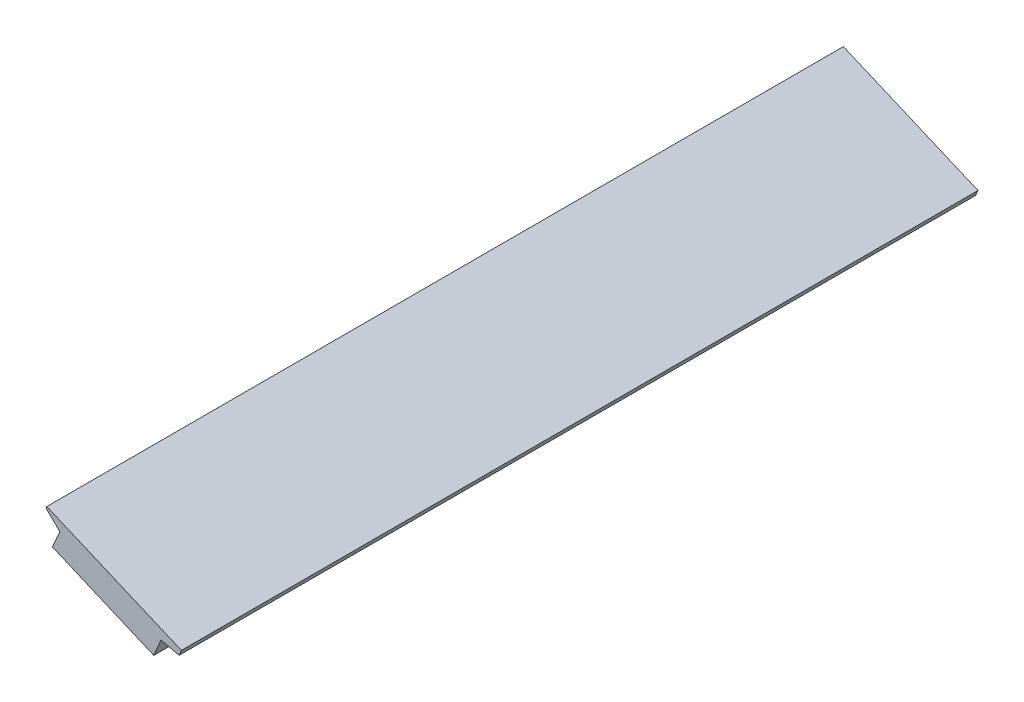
ISO-10303-21;
HEADER;
FILE_DESCRIPTION(('STEP AP214'),'2;1');
FILE_NAME('part.step','',(''),(''),'','','');
FILE_SCHEMA(('AUTOMOTIVE_DESIGN { 1 0 10303 214 1 1 1 1 }'));
ENDSEC;
DATA;
#1=APPLICATION_CONTEXT('core data for automotive mechanical design processes');
#2=APPLICATION_PROTOCOL_DEFINITION('international standard','automotive_design',2000,#1);
#3=PRODUCT_CONTEXT('',#1,'mechanical');
#4=PRODUCT('Part','Part','',(#3));
#5=PRODUCT_RELATED_PRODUCT_CATEGORY('part','',(#4));
#6=PRODUCT_DEFINITION_FORMATION('','',#4);
#7=PRODUCT_DEFINITION_CONTEXT('part definition',#1,'design');
#8=PRODUCT_DEFINITION('design','',#6,#7);
#9=PRODUCT_DEFINITION_SHAPE('','',#8);
#10=(LENGTH_UNIT() NAMED_UNIT(*) SI_UNIT(.MILLI.,.METRE.));
#11=(NAMED_UNIT(*) PLANE_ANGLE_UNIT() SI_UNIT($,.RADIAN.));
#12=(NAMED_UNIT(*) SI_UNIT($,.STERADIAN.) SOLID_ANGLE_UNIT());
#13=UNCERTAINTY_MEASURE_WITH_UNIT(LENGTH_MEASURE(1.E-05),#10,'distance_accuracy_value','');
#14=(GEOMETRIC_REPRESENTATION_CONTEXT(3) GLOBAL_UNCERTAINTY_ASSIGNED_CONTEXT((#13)) GLOBAL_UNIT_ASSIGNED_CONTEXT((#10,
#11,#12)) REPRESENTATION_CONTEXT('',''));
#15=CARTESIAN_POINT('',(0.,0.,0.));
#16=DIRECTION('',(0.,0.,1.));
#17=DIRECTION('',(1.,0.,0.));
#18=AXIS2_PLACEMENT_3D('',#15,#16,#17);
#19=CARTESIAN_POINT('',(-20.,-17.3718686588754,43.5));
#20=DIRECTION('',(-0.920081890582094,0.391726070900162,0.));
#21=DIRECTION('',(-0.391726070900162,-0.920081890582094,0.));
#22=AXIS2_PLACEMENT_3D('',#19,#20,#21);
#23=PLANE('',#22);
#24=DIRECTION('',(0.391726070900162,0.920081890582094,0.));
#25=VECTOR('',#24,1.);
#26=CARTESIAN_POINT('',(-20.,-17.3718686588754,-43.5));
#27=LINE('',#26,#25);
#28=CARTESIAN_POINT('',(-20.7866948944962,-19.2196489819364,-43.5));
#29=VERTEX_POINT('',#28);
#30=CARTESIAN_POINT('',(-20.,-17.3718686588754,-43.5));
#31=VERTEX_POINT('',#30);
#32=EDGE_CURVE('E94',#29,#31,#27,.T.);
#33=ORIENTED_EDGE('',*,*,#32,.T.);
#34=DIRECTION('',(0.,0.,-1.));
#35=VECTOR('',#34,1.);
#36=CARTESIAN_POINT('',(-20.,-17.3718686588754,43.5));
#37=LINE('',#36,#35);
#38=CARTESIAN_POINT('',(-20.,-17.3718686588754,43.5));
#39=VERTEX_POINT('',#38);
#40=EDGE_CURVE('E11',#39,#31,#37,.T.);
#41=ORIENTED_EDGE('',*,*,#40,.F.);
#42=DIRECTION('',(0.391726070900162,0.920081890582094,0.));
#43=VECTOR('',#42,1.);
#44=CARTESIAN_POINT('',(-20.,-17.3718686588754,43.5));
#45=LINE('',#44,#43);
#46=CARTESIAN_POINT('',(-20.7866948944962,-19.2196489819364,43.5));
#47=VERTEX_POINT('',#46);
#48=EDGE_CURVE('E121',#47,#39,#45,.T.);
#49=ORIENTED_EDGE('',*,*,#48,.F.);
#50=DIRECTION('',(0.,0.,-1.));
#51=VECTOR('',#50,1.);
#52=CARTESIAN_POINT('',(-20.7866948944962,-19.2196489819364,43.5));
#53=LINE('',#52,#51);
#54=EDGE_CURVE('E107',#47,#29,#53,.T.);
#55=ORIENTED_EDGE('',*,*,#54,.T.);
#56=EDGE_LOOP('',(#33,#41,#49,#55));
#57=FACE_BOUND('',#56,.T.);
#58=ADVANCED_FACE('F26',(#57),#23,.F.);
#59=CARTESIAN_POINT('',(-18.0216924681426,-17.830850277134,43.5));
#60=DIRECTION('',(0.226004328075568,0.974126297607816,0.));
#61=DIRECTION('',(-0.974126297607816,0.226004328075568,0.));
#62=AXIS2_PLACEMENT_3D('',#59,#60,#61);
#63=PLANE('',#62);
#64=DIRECTION('',(0.974126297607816,-0.226004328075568,0.));
#65=VECTOR('',#64,1.);
#66=CARTESIAN_POINT('',(-18.0216924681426,-17.830850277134,-43.5));
#67=LINE('',#66,#65);
#68=CARTESIAN_POINT('',(-18.0216924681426,-17.830850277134,-43.5));
#69=VERTEX_POINT('',#68);
#70=EDGE_CURVE('E90',#31,#69,#67,.T.);
#71=ORIENTED_EDGE('',*,*,#70,.T.);
#72=DIRECTION('',(0.,0.,-1.));
#73=VECTOR('',#72,1.);
#74=CARTESIAN_POINT('',(-18.0216924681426,-17.830850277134,43.5));
#75=LINE('',#74,#73);
#76=CARTESIAN_POINT('',(-18.0216924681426,-17.830850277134,43.5));
#77=VERTEX_POINT('',#76);
#78=EDGE_CURVE('E33',#77,#69,#75,.T.);
#79=ORIENTED_EDGE('',*,*,#78,.F.);
#80=DIRECTION('',(0.974126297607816,-0.226004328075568,0.));
#81=VECTOR('',#80,1.);
#82=CARTESIAN_POINT('',(-18.0216924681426,-17.830850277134,43.5));
#83=LINE('',#82,#81);
#84=EDGE_CURVE('E103',#39,#77,#83,.T.);
#85=ORIENTED_EDGE('',*,*,#84,.F.);
#86=ORIENTED_EDGE('',*,*,#40,.T.);
#87=EDGE_LOOP('',(#71,#79,#85,#86));
#88=FACE_BOUND('',#87,.T.);
#89=ADVANCED_FACE('F102',(#88),#63,.F.);
#90=CARTESIAN_POINT('',(-17.7713280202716,-17.2425890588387,43.5));
#91=DIRECTION('',(-0.920131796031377,0.391608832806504,0.));
#92=DIRECTION('',(-0.391608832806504,-0.920131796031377,0.));
#93=AXIS2_PLACEMENT_3D('',#90,#91,#92);
#94=PLANE('',#93);
#95=DIRECTION('',(0.391608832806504,0.920131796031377,0.));
#96=VECTOR('',#95,1.);
#97=CARTESIAN_POINT('',(-17.7713280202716,-17.2425890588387,-43.5));
#98=LINE('',#97,#96);
#99=CARTESIAN_POINT('',(-17.7713280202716,-17.2425890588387,-43.5));
#100=VERTEX_POINT('',#99);
#101=EDGE_CURVE('E96',#69,#100,#98,.T.);
#102=ORIENTED_EDGE('',*,*,#101,.T.);
#103=DIRECTION('',(0.,0.,-1.));
#104=VECTOR('',#103,1.);
#105=CARTESIAN_POINT('',(-17.7713280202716,-17.2425890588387,43.5));
#106=LINE('',#105,#104);
#107=CARTESIAN_POINT('',(-17.7713280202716,-17.2425890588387,43.5));
#108=VERTEX_POINT('',#107);
#109=EDGE_CURVE('E147',#108,#100,#106,.T.);
#110=ORIENTED_EDGE('',*,*,#109,.F.);
#111=DIRECTION('',(0.391608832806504,0.920131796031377,0.));
#112=VECTOR('',#111,1.);
#113=CARTESIAN_POINT('',(-17.7713280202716,-17.2425890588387,43.5));
#114=LINE('',#113,#112);
#115=EDGE_CURVE('E124',#77,#108,#114,.T.);
#116=ORIENTED_EDGE('',*,*,#115,.F.);
#117=ORIENTED_EDGE('',*,*,#78,.T.);
#118=EDGE_LOOP('',(#102,#110,#116,#117));
#119=FACE_BOUND('',#118,.T.);
#120=ADVANCED_FACE('F151',(#119),#94,.F.);
#121=CARTESIAN_POINT('',(-32.4736629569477,-10.9852634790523,43.5));
#122=DIRECTION('',(-0.391608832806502,-0.920131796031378,0.));
#123=DIRECTION('',(0.920131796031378,-0.391608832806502,0.));
#124=AXIS2_PLACEMENT_3D('',#121,#122,#123);
#125=PLANE('',#124);
#126=DIRECTION('',(-0.920131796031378,0.391608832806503,0.));
#127=VECTOR('',#126,1.);
#128=CARTESIAN_POINT('',(-32.4736629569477,-10.9852634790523,-43.5));
#129=LINE('',#128,#127);
#130=CARTESIAN_POINT('',(-32.4736629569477,-10.9852634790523,-43.5));
#131=VERTEX_POINT('',#130);
#132=EDGE_CURVE('E111',#100,#131,#129,.T.);
#133=ORIENTED_EDGE('',*,*,#132,.T.);
#134=DIRECTION('',(0.,0.,-1.));
#135=VECTOR('',#134,1.);
#136=CARTESIAN_POINT('',(-32.4736629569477,-10.9852634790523,43.5));
#137=LINE('',#136,#135);
#138=CARTESIAN_POINT('',(-32.4736629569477,-10.9852634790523,43.5));
#139=VERTEX_POINT('',#138);
#140=EDGE_CURVE('E144',#139,#131,#137,.T.);
#141=ORIENTED_EDGE('',*,*,#140,.F.);
#142=DIRECTION('',(-0.920131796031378,0.391608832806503,0.));
#143=VECTOR('',#142,1.);
#144=CARTESIAN_POINT('',(-32.4736629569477,-10.9852634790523,43.5));
#145=LINE('',#144,#143);
#146=EDGE_CURVE('E126',#108,#139,#145,.T.);
#147=ORIENTED_EDGE('',*,*,#146,.F.);
#148=ORIENTED_EDGE('',*,*,#109,.T.);
#149=EDGE_LOOP('',(#133,#141,#147,#148));
#150=FACE_BOUND('',#149,.T.);
#151=ADVANCED_FACE('F159',(#150),#125,.F.);
#152=CARTESIAN_POINT('',(-32.5603672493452,-11.1769443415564,43.5));
#153=DIRECTION('',(0.91112305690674,-0.412134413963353,0.));
#154=DIRECTION('',(0.412134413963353,0.91112305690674,0.));
#155=AXIS2_PLACEMENT_3D('',#152,#153,#154);
#156=PLANE('',#155);
#157=DIRECTION('',(-0.412134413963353,-0.91112305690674,0.));
#158=VECTOR('',#157,1.);
#159=CARTESIAN_POINT('',(-32.5603672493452,-11.1769443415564,-43.5));
#160=LINE('',#159,#158);
#161=CARTESIAN_POINT('',(-32.5603672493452,-11.1769443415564,-43.5));
#162=VERTEX_POINT('',#161);
#163=EDGE_CURVE('E113',#131,#162,#160,.T.);
#164=ORIENTED_EDGE('',*,*,#163,.T.);
#165=DIRECTION('',(0.,0.,-1.));
#166=VECTOR('',#165,1.);
#167=CARTESIAN_POINT('',(-32.5603672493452,-11.1769443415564,43.5));
#168=LINE('',#167,#166);
#169=CARTESIAN_POINT('',(-32.5603672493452,-11.1769443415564,43.5));
#170=VERTEX_POINT('',#169);
#171=EDGE_CURVE('E141',#170,#162,#168,.T.);
#172=ORIENTED_EDGE('',*,*,#171,.F.);
#173=DIRECTION('',(-0.412134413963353,-0.91112305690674,0.));
#174=VECTOR('',#173,1.);
#175=CARTESIAN_POINT('',(-32.5603672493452,-11.1769443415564,43.5));
#176=LINE('',#175,#174);
#177=EDGE_CURVE('E128',#139,#170,#176,.T.);
#178=ORIENTED_EDGE('',*,*,#177,.F.);
#179=ORIENTED_EDGE('',*,*,#140,.T.);
#180=EDGE_LOOP('',(#164,#172,#178,#179));
#181=FACE_BOUND('',#180,.T.);
#182=ADVANCED_FACE('F162',(#181),#156,.F.);
#183=CARTESIAN_POINT('',(-31.0381304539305,-12.6644565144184,43.5));
#184=DIRECTION('',(0.698902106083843,0.715217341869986,0.));
#185=DIRECTION('',(-0.715217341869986,0.698902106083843,0.));
#186=AXIS2_PLACEMENT_3D('',#183,#184,#185);
#187=PLANE('',#186);
#188=DIRECTION('',(0.715217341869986,-0.698902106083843,0.));
#189=VECTOR('',#188,1.);
#190=CARTESIAN_POINT('',(-31.0381304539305,-12.6644565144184,-43.5));
#191=LINE('',#190,#189);
#192=CARTESIAN_POINT('',(-31.0381304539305,-12.6644565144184,-43.5));
#193=VERTEX_POINT('',#192);
#194=EDGE_CURVE('E115',#162,#193,#191,.T.);
#195=ORIENTED_EDGE('',*,*,#194,.T.);
#196=DIRECTION('',(0.,0.,-1.));
#197=VECTOR('',#196,1.);
#198=CARTESIAN_POINT('',(-31.0381304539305,-12.6644565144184,43.5));
#199=LINE('',#198,#197);
#200=CARTESIAN_POINT('',(-31.0381304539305,-12.6644565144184,43.5));
#201=VERTEX_POINT('',#200);
#202=EDGE_CURVE('E138',#201,#193,#199,.T.);
#203=ORIENTED_EDGE('',*,*,#202,.F.);
#204=DIRECTION('',(0.715217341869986,-0.698902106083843,0.));
#205=VECTOR('',#204,1.);
#206=CARTESIAN_POINT('',(-31.0381304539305,-12.6644565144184,43.5));
#207=LINE('',#206,#205);
#208=EDGE_CURVE('E130',#170,#201,#207,.T.);
#209=ORIENTED_EDGE('',*,*,#208,.F.);
#210=ORIENTED_EDGE('',*,*,#171,.T.);
#211=EDGE_LOOP('',(#195,#203,#209,#210));
#212=FACE_BOUND('',#211,.T.);
#213=ADVANCED_FACE('F167',(#212),#187,.F.);
#214=CARTESIAN_POINT('',(-31.8696508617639,-14.5027340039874,43.5));
#215=DIRECTION('',(0.911123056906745,-0.412134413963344,0.));
#216=DIRECTION('',(0.412134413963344,0.911123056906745,0.));
#217=AXIS2_PLACEMENT_3D('',#214,#215,#216);
#218=PLANE('',#217);
#219=DIRECTION('',(-0.412134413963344,-0.911123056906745,0.));
#220=VECTOR('',#219,1.);
#221=CARTESIAN_POINT('',(-31.8696508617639,-14.5027340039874,-43.5));
#222=LINE('',#221,#220);
#223=CARTESIAN_POINT('',(-31.8696508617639,-14.5027340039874,-43.5));
#224=VERTEX_POINT('',#223);
#225=EDGE_CURVE('E117',#193,#224,#222,.T.);
#226=ORIENTED_EDGE('',*,*,#225,.T.);
#227=DIRECTION('',(0.,0.,-1.));
#228=VECTOR('',#227,1.);
#229=CARTESIAN_POINT('',(-31.8696508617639,-14.5027340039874,43.5));
#230=LINE('',#229,#228);
#231=CARTESIAN_POINT('',(-31.8696508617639,-14.5027340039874,43.5));
#232=VERTEX_POINT('',#231);
#233=EDGE_CURVE('E135',#232,#224,#230,.T.);
#234=ORIENTED_EDGE('',*,*,#233,.F.);
#235=DIRECTION('',(-0.412134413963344,-0.911123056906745,0.));
#236=VECTOR('',#235,1.);
#237=CARTESIAN_POINT('',(-31.8696508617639,-14.5027340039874,43.5));
#238=LINE('',#237,#236);
#239=EDGE_CURVE('E45',#201,#232,#238,.T.);
#240=ORIENTED_EDGE('',*,*,#239,.F.);
#241=ORIENTED_EDGE('',*,*,#202,.T.);
#242=EDGE_LOOP('',(#226,#234,#240,#241));
#243=FACE_BOUND('',#242,.T.);
#244=ADVANCED_FACE('F170',(#243),#218,.F.);
#245=CARTESIAN_POINT('',(-20.7866948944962,-19.2196489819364,43.5));
#246=DIRECTION('',(0.391608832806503,0.920131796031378,0.));
#247=DIRECTION('',(-0.920131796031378,0.391608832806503,0.));
#248=AXIS2_PLACEMENT_3D('',#245,#246,#247);
#249=PLANE('',#248);
#250=DIRECTION('',(0.920131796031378,-0.391608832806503,0.));
#251=VECTOR('',#250,1.);
#252=CARTESIAN_POINT('',(-20.7866948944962,-19.2196489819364,-43.5));
#253=LINE('',#252,#251);
#254=EDGE_CURVE('E119',#224,#29,#253,.T.);
#255=ORIENTED_EDGE('',*,*,#254,.T.);
#256=ORIENTED_EDGE('',*,*,#54,.F.);
#257=DIRECTION('',(0.920131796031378,-0.391608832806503,0.));
#258=VECTOR('',#257,1.);
#259=CARTESIAN_POINT('',(-20.7866948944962,-19.2196489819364,43.5));
#260=LINE('',#259,#258);
#261=EDGE_CURVE('E40',#232,#47,#260,.T.);
#262=ORIENTED_EDGE('',*,*,#261,.F.);
#263=ORIENTED_EDGE('',*,*,#233,.T.);
#264=EDGE_LOOP('',(#255,#256,#262,#263));
#265=FACE_BOUND('',#264,.T.);
#266=ADVANCED_FACE('F172',(#265),#249,.F.);
#267=CARTESIAN_POINT('',(-20.7866948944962,-19.2196489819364,43.5));
#268=DIRECTION('',(0.,0.,-1.));
#269=DIRECTION('',(-1.,0.,0.));
#270=AXIS2_PLACEMENT_3D('',#267,#268,#269);
#271=PLANE('',#270);
#272=ORIENTED_EDGE('',*,*,#48,.T.);
#273=ORIENTED_EDGE('',*,*,#84,.T.);
#274=ORIENTED_EDGE('',*,*,#115,.T.);
#275=ORIENTED_EDGE('',*,*,#146,.T.);
#276=ORIENTED_EDGE('',*,*,#177,.T.);
#277=ORIENTED_EDGE('',*,*,#208,.T.);
#278=ORIENTED_EDGE('',*,*,#239,.T.);
#279=ORIENTED_EDGE('',*,*,#261,.T.);
#280=EDGE_LOOP('',(#272,#273,#274,#275,#276,#277,#278,#279));
#281=FACE_BOUND('',#280,.T.);
#282=ADVANCED_FACE('F154',(#281),#271,.F.);
#283=CARTESIAN_POINT('',(-20.7866948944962,-19.2196489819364,-43.5));
#284=DIRECTION('',(0.,0.,-1.));
#285=DIRECTION('',(-1.,0.,0.));
#286=AXIS2_PLACEMENT_3D('',#283,#284,#285);
#287=PLANE('',#286);
#288=ORIENTED_EDGE('',*,*,#32,.F.);
#289=ORIENTED_EDGE('',*,*,#254,.F.);
#290=ORIENTED_EDGE('',*,*,#225,.F.);
#291=ORIENTED_EDGE('',*,*,#194,.F.);
#292=ORIENTED_EDGE('',*,*,#163,.F.);
#293=ORIENTED_EDGE('',*,*,#132,.F.);
#294=ORIENTED_EDGE('',*,*,#101,.F.);
#295=ORIENTED_EDGE('',*,*,#70,.F.);
#296=EDGE_LOOP('',(#288,#289,#290,#291,#292,#293,#294,#295));
#297=FACE_BOUND('',#296,.T.);
#298=ADVANCED_FACE('F91',(#297),#287,.T.);
#299=CLOSED_SHELL('',(#58,#89,#120,#151,#182,#213,#244,#266,#282,#298));
#300=MANIFOLD_SOLID_BREP('B2',#299);
#301=ADVANCED_BREP_SHAPE_REPRESENTATION('',(#18,#300),#14);
#302=SHAPE_DEFINITION_REPRESENTATION(#9,#301);
ENDSEC;
END-ISO-10303-21;
